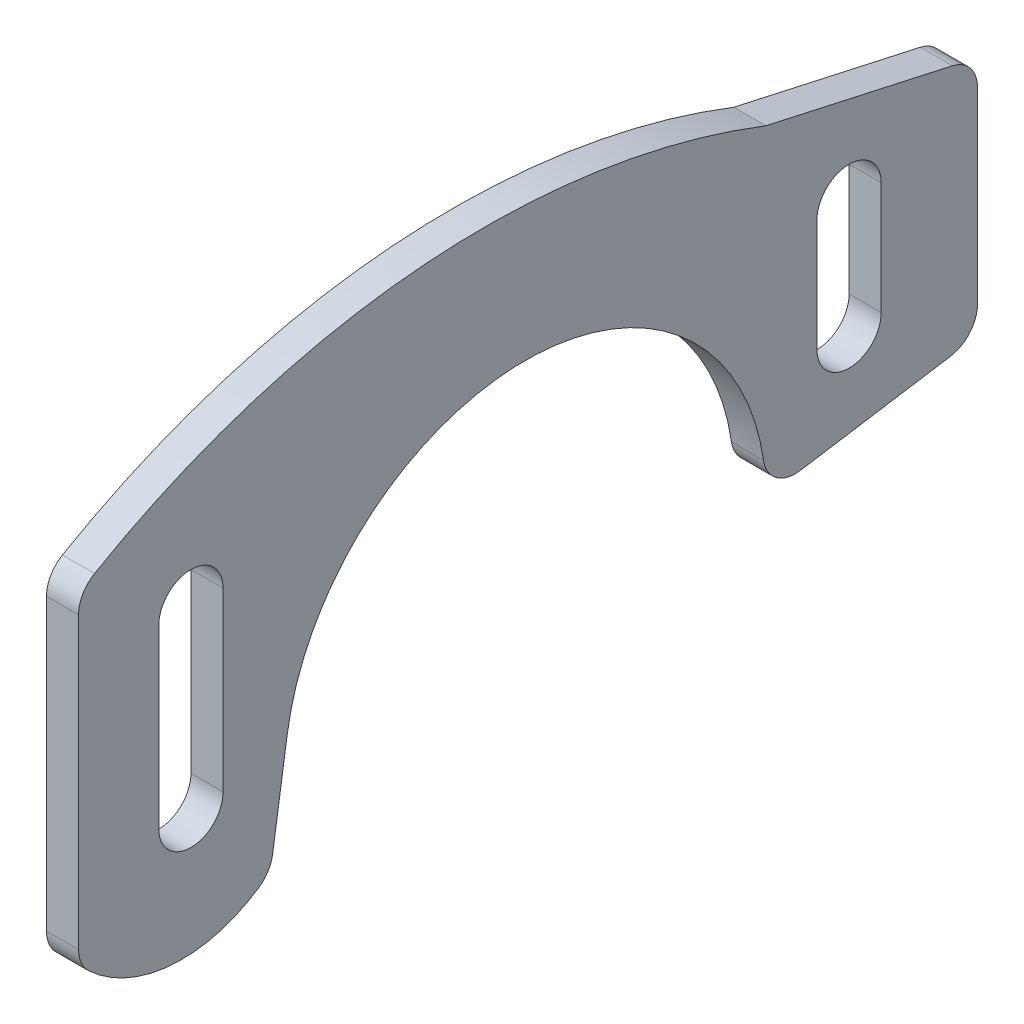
ISO-10303-21;
HEADER;
FILE_DESCRIPTION(('STEP AP214'),'2;1');
FILE_NAME('part.step','',(''),(''),'','','');
FILE_SCHEMA(('AUTOMOTIVE_DESIGN { 1 0 10303 214 1 1 1 1 }'));
ENDSEC;
DATA;
#1=APPLICATION_CONTEXT('core data for automotive mechanical design processes');
#2=APPLICATION_PROTOCOL_DEFINITION('international standard','automotive_design',2000,#1);
#3=PRODUCT_CONTEXT('',#1,'mechanical');
#4=PRODUCT('Part','Part','',(#3));
#5=PRODUCT_RELATED_PRODUCT_CATEGORY('part','',(#4));
#6=PRODUCT_DEFINITION_FORMATION('','',#4);
#7=PRODUCT_DEFINITION_CONTEXT('part definition',#1,'design');
#8=PRODUCT_DEFINITION('design','',#6,#7);
#9=PRODUCT_DEFINITION_SHAPE('','',#8);
#10=(LENGTH_UNIT() NAMED_UNIT(*) SI_UNIT(.MILLI.,.METRE.));
#11=(NAMED_UNIT(*) PLANE_ANGLE_UNIT() SI_UNIT($,.RADIAN.));
#12=(NAMED_UNIT(*) SI_UNIT($,.STERADIAN.) SOLID_ANGLE_UNIT());
#13=UNCERTAINTY_MEASURE_WITH_UNIT(LENGTH_MEASURE(1.E-05),#10,'distance_accuracy_value','');
#14=(GEOMETRIC_REPRESENTATION_CONTEXT(3) GLOBAL_UNCERTAINTY_ASSIGNED_CONTEXT((#13)) GLOBAL_UNIT_ASSIGNED_CONTEXT((#10,
#11,#12)) REPRESENTATION_CONTEXT('',''));
#15=CARTESIAN_POINT('',(0.,0.,0.));
#16=DIRECTION('',(0.,0.,1.));
#17=DIRECTION('',(1.,0.,0.));
#18=AXIS2_PLACEMENT_3D('',#15,#16,#17);
#19=CARTESIAN_POINT('',(2.,-16.3283950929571,-27.8306029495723));
#20=DIRECTION('',(-1.,0.,0.));
#21=DIRECTION('',(0.,0.,1.));
#22=AXIS2_PLACEMENT_3D('',#19,#20,#21);
#23=PLANE('',#22);
#24=CARTESIAN_POINT('',(2.,-4.1912536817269,-7.));
#25=DIRECTION('',(1.,0.,0.));
#26=DIRECTION('',(0.,0.,-1.));
#27=AXIS2_PLACEMENT_3D('',#24,#25,#26);
#28=CIRCLE('',#27,2.);
#29=CARTESIAN_POINT('',(2.,-4.1912536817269,-9.));
#30=VERTEX_POINT('',#29);
#31=CARTESIAN_POINT('',(2.,-4.1912536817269,-5.));
#32=VERTEX_POINT('',#31);
#33=EDGE_CURVE('E217',#30,#32,#28,.T.);
#34=ORIENTED_EDGE('',*,*,#33,.F.);
#35=DIRECTION('',(0.,1.,0.));
#36=VECTOR('',#35,1.);
#37=CARTESIAN_POINT('',(2.,-4.1912536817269,-9.));
#38=LINE('',#37,#36);
#39=CARTESIAN_POINT('',(2.,-15.1912536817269,-9.));
#40=VERTEX_POINT('',#39);
#41=EDGE_CURVE('E225',#40,#30,#38,.T.);
#42=ORIENTED_EDGE('',*,*,#41,.F.);
#43=CARTESIAN_POINT('',(2.,-15.1912536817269,-7.));
#44=DIRECTION('',(1.,0.,0.));
#45=DIRECTION('',(0.,0.,-1.));
#46=AXIS2_PLACEMENT_3D('',#43,#44,#45);
#47=CIRCLE('',#46,2.);
#48=CARTESIAN_POINT('',(2.,-15.1912536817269,-5.));
#49=VERTEX_POINT('',#48);
#50=EDGE_CURVE('E222',#49,#40,#47,.T.);
#51=ORIENTED_EDGE('',*,*,#50,.F.);
#52=DIRECTION('',(0.,-1.,0.));
#53=VECTOR('',#52,1.);
#54=CARTESIAN_POINT('',(2.,-4.1912536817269,-5.));
#55=LINE('',#54,#53);
#56=EDGE_CURVE('E219',#32,#49,#55,.T.);
#57=ORIENTED_EDGE('',*,*,#56,.F.);
#58=EDGE_LOOP('',(#34,#42,#51,#57));
#59=FACE_BOUND('',#58,.T.);
#60=CARTESIAN_POINT('',(2.,-16.3283950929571,-27.8306029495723));
#61=DIRECTION('',(-1.,0.,0.));
#62=DIRECTION('',(0.,0.,1.));
#63=AXIS2_PLACEMENT_3D('',#60,#61,#62);
#64=CIRCLE('',#63,15.);
#65=CARTESIAN_POINT('',(2.,-14.0804591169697,-13.));
#66=VERTEX_POINT('',#65);
#67=CARTESIAN_POINT('',(2.,-14.1444687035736,-42.6707668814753));
#68=VERTEX_POINT('',#67);
#69=EDGE_CURVE('E248',#66,#68,#64,.T.);
#70=ORIENTED_EDGE('',*,*,#69,.T.);
#71=CARTESIAN_POINT('',(2.,-13.8532785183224,-44.649455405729));
#72=DIRECTION('',(1.,0.,0.));
#73=DIRECTION('',(0.,0.,-1.));
#74=AXIS2_PLACEMENT_3D('',#71,#72,#73);
#75=CIRCLE('',#74,1.99999999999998);
#76=CARTESIAN_POINT('',(2.,-15.8286551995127,-44.9623243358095));
#77=VERTEX_POINT('',#76);
#78=EDGE_CURVE('E251',#68,#77,#75,.T.);
#79=ORIENTED_EDGE('',*,*,#78,.T.);
#80=DIRECTION('',(0.,0.156434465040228,-0.987688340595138));
#81=VECTOR('',#80,1.);
#82=CARTESIAN_POINT('',(2.,-14.3476744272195,-54.3128689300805));
#83=LINE('',#82,#81);
#84=CARTESIAN_POINT('',(2.,-14.3476744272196,-54.3128689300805));
#85=VERTEX_POINT('',#84);
#86=EDGE_CURVE('E254',#77,#85,#83,.T.);
#87=ORIENTED_EDGE('',*,*,#86,.T.);
#88=CARTESIAN_POINT('',(2.,-12.3722977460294,-54.));
#89=DIRECTION('',(1.,0.,0.));
#90=DIRECTION('',(0.,0.,1.));
#91=AXIS2_PLACEMENT_3D('',#88,#89,#90);
#92=CIRCLE('',#91,1.99999999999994);
#93=CARTESIAN_POINT('',(2.,-12.3722977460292,-56.));
#94=VERTEX_POINT('',#93);
#95=EDGE_CURVE('E256',#85,#94,#92,.T.);
#96=ORIENTED_EDGE('',*,*,#95,.T.);
#97=DIRECTION('',(0.,1.,0.));
#98=VECTOR('',#97,1.);
#99=CARTESIAN_POINT('',(2.,-0.686312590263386,-56.));
#100=LINE('',#99,#98);
#101=CARTESIAN_POINT('',(2.,-0.686312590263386,-56.));
#102=VERTEX_POINT('',#101);
#103=EDGE_CURVE('E258',#94,#102,#100,.T.);
#104=ORIENTED_EDGE('',*,*,#103,.T.);
#105=CARTESIAN_POINT('',(2.,-0.686312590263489,-54.));
#106=DIRECTION('',(1.,0.,0.));
#107=DIRECTION('',(0.,0.,1.));
#108=AXIS2_PLACEMENT_3D('',#105,#106,#107);
#109=CIRCLE('',#108,2.00000000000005);
#110=CARTESIAN_POINT('',(2.,1.26645925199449,-54.4320672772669));
#111=VERTEX_POINT('',#110);
#112=EDGE_CURVE('E260',#102,#111,#109,.T.);
#113=ORIENTED_EDGE('',*,*,#112,.T.);
#114=DIRECTION('',(0.,0.216033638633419,0.976385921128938));
#115=VECTOR('',#114,1.);
#116=CARTESIAN_POINT('',(2.,3.83357479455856,-42.8297284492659));
#117=LINE('',#116,#115);
#118=CARTESIAN_POINT('',(2.,3.83357479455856,-42.8297284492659));
#119=VERTEX_POINT('',#118);
#120=EDGE_CURVE('E262',#111,#119,#117,.T.);
#121=ORIENTED_EDGE('',*,*,#120,.T.);
#122=CARTESIAN_POINT('',(2.,-41.215448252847,-25.2755156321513));
#123=DIRECTION('',(1.,0.,0.));
#124=DIRECTION('',(0.,0.,1.));
#125=AXIS2_PLACEMENT_3D('',#122,#123,#124);
#126=CIRCLE('',#125,48.3483698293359);
#127=CARTESIAN_POINT('',(2.,0.594262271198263,-0.995627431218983));
#128=VERTEX_POINT('',#127);
#129=EDGE_CURVE('E264',#119,#128,#126,.T.);
#130=ORIENTED_EDGE('',*,*,#129,.T.);
#131=CARTESIAN_POINT('',(2.,-1.13525666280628,-2.));
#132=DIRECTION('',(1.,0.,0.));
#133=DIRECTION('',(0.,0.,1.));
#134=AXIS2_PLACEMENT_3D('',#131,#132,#133);
#135=CIRCLE('',#134,2.);
#136=CARTESIAN_POINT('',(2.,-1.13525666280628,0.));
#137=VERTEX_POINT('',#136);
#138=EDGE_CURVE('E266',#128,#137,#135,.T.);
#139=ORIENTED_EDGE('',*,*,#138,.T.);
#140=DIRECTION('',(0.,-1.,0.));
#141=VECTOR('',#140,1.);
#142=CARTESIAN_POINT('',(2.,-1.13525666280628,0.));
#143=LINE('',#142,#141);
#144=CARTESIAN_POINT('',(2.,-19.1985800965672,0.));
#145=VERTEX_POINT('',#144);
#146=EDGE_CURVE('E268',#137,#145,#143,.T.);
#147=ORIENTED_EDGE('',*,*,#146,.T.);
#148=CARTESIAN_POINT('',(2.,-19.1985800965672,-2.));
#149=DIRECTION('',(1.,0.,0.));
#150=DIRECTION('',(0.,0.,-1.));
#151=AXIS2_PLACEMENT_3D('',#148,#149,#150);
#152=CIRCLE('',#151,2.);
#153=CARTESIAN_POINT('',(2.,-20.6605779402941,-0.635242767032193));
#154=VERTEX_POINT('',#153);
#155=EDGE_CURVE('E270',#145,#154,#152,.T.);
#156=ORIENTED_EDGE('',*,*,#155,.T.);
#157=CARTESIAN_POINT('',(2.,-14.4470871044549,-6.43546100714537));
#158=DIRECTION('',(1.,0.,0.));
#159=DIRECTION('',(0.,0.,-1.));
#160=AXIS2_PLACEMENT_3D('',#157,#158,#159);
#161=CIRCLE('',#160,8.5);
#162=CARTESIAN_POINT('',(2.,-21.4596427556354,-11.2390079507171));
#163=VERTEX_POINT('',#162);
#164=EDGE_CURVE('E272',#154,#163,#161,.T.);
#165=ORIENTED_EDGE('',*,*,#164,.T.);
#166=CARTESIAN_POINT('',(2.,-19.8096296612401,-10.1087616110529));
#167=DIRECTION('',(1.,0.,0.));
#168=DIRECTION('',(0.,0.,-1.));
#169=AXIS2_PLACEMENT_3D('',#166,#167,#168);
#170=CIRCLE('',#169,2.00000000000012);
#171=CARTESIAN_POINT('',(2.,-20.1093544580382,-12.0861753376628));
#172=VERTEX_POINT('',#171);
#173=EDGE_CURVE('E274',#163,#172,#170,.T.);
#174=ORIENTED_EDGE('',*,*,#173,.T.);
#175=DIRECTION('',(0.,0.988706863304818,-0.149862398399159));
#176=VECTOR('',#175,1.);
#177=CARTESIAN_POINT('',(2.,-20.1093544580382,-12.0861753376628));
#178=LINE('',#177,#176);
#179=EDGE_CURVE('E276',#172,#66,#178,.T.);
#180=ORIENTED_EDGE('',*,*,#179,.T.);
#181=EDGE_LOOP('',(#70,#79,#87,#96,#104,#113,#121,#130,#139,#147,#156,#165,#174,#180));
#182=FACE_BOUND('',#181,.T.);
#183=CARTESIAN_POINT('',(2.,-2.82896306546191,-48.));
#184=DIRECTION('',(1.,0.,0.));
#185=DIRECTION('',(0.,0.,-1.));
#186=AXIS2_PLACEMENT_3D('',#183,#184,#185);
#187=CIRCLE('',#186,2.);
#188=CARTESIAN_POINT('',(2.,-2.82896306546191,-50.));
#189=VERTEX_POINT('',#188);
#190=CARTESIAN_POINT('',(2.,-2.82896306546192,-46.));
#191=VERTEX_POINT('',#190);
#192=EDGE_CURVE('E181',#189,#191,#187,.T.);
#193=ORIENTED_EDGE('',*,*,#192,.F.);
#194=DIRECTION('',(0.,1.,0.));
#195=VECTOR('',#194,1.);
#196=CARTESIAN_POINT('',(2.,-2.82896306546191,-50.));
#197=LINE('',#196,#195);
#198=CARTESIAN_POINT('',(2.,-9.82896306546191,-50.));
#199=VERTEX_POINT('',#198);
#200=EDGE_CURVE('E203',#199,#189,#197,.T.);
#201=ORIENTED_EDGE('',*,*,#200,.F.);
#202=CARTESIAN_POINT('',(2.,-9.82896306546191,-48.));
#203=DIRECTION('',(1.,0.,0.));
#204=DIRECTION('',(0.,0.,-1.));
#205=AXIS2_PLACEMENT_3D('',#202,#203,#204);
#206=CIRCLE('',#205,2.);
#207=CARTESIAN_POINT('',(2.,-9.82896306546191,-46.));
#208=VERTEX_POINT('',#207);
#209=EDGE_CURVE('E201',#208,#199,#206,.T.);
#210=ORIENTED_EDGE('',*,*,#209,.F.);
#211=DIRECTION('',(0.,-1.,0.));
#212=VECTOR('',#211,1.);
#213=CARTESIAN_POINT('',(2.,-2.82896306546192,-46.));
#214=LINE('',#213,#212);
#215=EDGE_CURVE('E189',#191,#208,#214,.T.);
#216=ORIENTED_EDGE('',*,*,#215,.F.);
#217=EDGE_LOOP('',(#193,#201,#210,#216));
#218=FACE_BOUND('',#217,.T.);
#219=ADVANCED_FACE('F32',(#59,#182,#218),#23,.F.);
#220=CARTESIAN_POINT('',(0.,-16.3283950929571,-27.8306029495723));
#221=DIRECTION('',(-1.,0.,0.));
#222=DIRECTION('',(0.,0.,1.));
#223=AXIS2_PLACEMENT_3D('',#220,#221,#222);
#224=PLANE('',#223);
#225=DIRECTION('',(0.,1.,0.));
#226=VECTOR('',#225,1.);
#227=CARTESIAN_POINT('',(0.,-4.1912536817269,-9.));
#228=LINE('',#227,#226);
#229=CARTESIAN_POINT('',(0.,-15.1912536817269,-9.));
#230=VERTEX_POINT('',#229);
#231=CARTESIAN_POINT('',(0.,-4.1912536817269,-9.));
#232=VERTEX_POINT('',#231);
#233=EDGE_CURVE('E220',#230,#232,#228,.T.);
#234=ORIENTED_EDGE('',*,*,#233,.T.);
#235=CARTESIAN_POINT('',(0.,-4.1912536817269,-7.));
#236=DIRECTION('',(1.,0.,0.));
#237=DIRECTION('',(0.,0.,-1.));
#238=AXIS2_PLACEMENT_3D('',#235,#236,#237);
#239=CIRCLE('',#238,2.);
#240=CARTESIAN_POINT('',(0.,-4.1912536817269,-5.));
#241=VERTEX_POINT('',#240);
#242=EDGE_CURVE('E197',#232,#241,#239,.T.);
#243=ORIENTED_EDGE('',*,*,#242,.T.);
#244=DIRECTION('',(0.,-1.,0.));
#245=VECTOR('',#244,1.);
#246=CARTESIAN_POINT('',(0.,-4.1912536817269,-5.));
#247=LINE('',#246,#245);
#248=CARTESIAN_POINT('',(0.,-15.1912536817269,-5.));
#249=VERTEX_POINT('',#248);
#250=EDGE_CURVE('E230',#241,#249,#247,.T.);
#251=ORIENTED_EDGE('',*,*,#250,.T.);
#252=CARTESIAN_POINT('',(0.,-15.1912536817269,-7.));
#253=DIRECTION('',(1.,0.,0.));
#254=DIRECTION('',(0.,0.,-1.));
#255=AXIS2_PLACEMENT_3D('',#252,#253,#254);
#256=CIRCLE('',#255,2.);
#257=EDGE_CURVE('E233',#249,#230,#256,.T.);
#258=ORIENTED_EDGE('',*,*,#257,.T.);
#259=EDGE_LOOP('',(#234,#243,#251,#258));
#260=FACE_BOUND('',#259,.T.);
#261=CARTESIAN_POINT('',(0.,-16.3283950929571,-27.8306029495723));
#262=DIRECTION('',(-1.,0.,0.));
#263=DIRECTION('',(0.,0.,1.));
#264=AXIS2_PLACEMENT_3D('',#261,#262,#263);
#265=CIRCLE('',#264,15.);
#266=CARTESIAN_POINT('',(0.,-14.0804591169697,-13.));
#267=VERTEX_POINT('',#266);
#268=CARTESIAN_POINT('',(0.,-14.1444687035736,-42.6707668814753));
#269=VERTEX_POINT('',#268);
#270=EDGE_CURVE('E247',#267,#269,#265,.T.);
#271=ORIENTED_EDGE('',*,*,#270,.F.);
#272=DIRECTION('',(0.,0.988706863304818,-0.149862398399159));
#273=VECTOR('',#272,1.);
#274=CARTESIAN_POINT('',(0.,-20.1093544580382,-12.0861753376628));
#275=LINE('',#274,#273);
#276=CARTESIAN_POINT('',(0.,-20.1093544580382,-12.0861753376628));
#277=VERTEX_POINT('',#276);
#278=EDGE_CURVE('E252',#277,#267,#275,.T.);
#279=ORIENTED_EDGE('',*,*,#278,.F.);
#280=CARTESIAN_POINT('',(0.,-19.8096296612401,-10.1087616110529));
#281=DIRECTION('',(1.,0.,0.));
#282=DIRECTION('',(0.,0.,-1.));
#283=AXIS2_PLACEMENT_3D('',#280,#281,#282);
#284=CIRCLE('',#283,2.00000000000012);
#285=CARTESIAN_POINT('',(0.,-21.4596427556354,-11.2390079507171));
#286=VERTEX_POINT('',#285);
#287=EDGE_CURVE('E303',#286,#277,#284,.T.);
#288=ORIENTED_EDGE('',*,*,#287,.F.);
#289=CARTESIAN_POINT('',(0.,-14.4470871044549,-6.43546100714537));
#290=DIRECTION('',(1.,0.,0.));
#291=DIRECTION('',(0.,0.,-1.));
#292=AXIS2_PLACEMENT_3D('',#289,#290,#291);
#293=CIRCLE('',#292,8.5);
#294=CARTESIAN_POINT('',(0.,-20.6605779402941,-0.635242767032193));
#295=VERTEX_POINT('',#294);
#296=EDGE_CURVE('E301',#295,#286,#293,.T.);
#297=ORIENTED_EDGE('',*,*,#296,.F.);
#298=CARTESIAN_POINT('',(0.,-19.1985800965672,-2.));
#299=DIRECTION('',(1.,0.,0.));
#300=DIRECTION('',(0.,0.,-1.));
#301=AXIS2_PLACEMENT_3D('',#298,#299,#300);
#302=CIRCLE('',#301,2.);
#303=CARTESIAN_POINT('',(0.,-19.1985800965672,0.));
#304=VERTEX_POINT('',#303);
#305=EDGE_CURVE('E299',#304,#295,#302,.T.);
#306=ORIENTED_EDGE('',*,*,#305,.F.);
#307=DIRECTION('',(0.,-1.,0.));
#308=VECTOR('',#307,1.);
#309=CARTESIAN_POINT('',(0.,-1.13525666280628,0.));
#310=LINE('',#309,#308);
#311=CARTESIAN_POINT('',(0.,-1.13525666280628,0.));
#312=VERTEX_POINT('',#311);
#313=EDGE_CURVE('E297',#312,#304,#310,.T.);
#314=ORIENTED_EDGE('',*,*,#313,.F.);
#315=CARTESIAN_POINT('',(0.,-1.13525666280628,-2.));
#316=DIRECTION('',(1.,0.,0.));
#317=DIRECTION('',(0.,0.,1.));
#318=AXIS2_PLACEMENT_3D('',#315,#316,#317);
#319=CIRCLE('',#318,2.);
#320=CARTESIAN_POINT('',(0.,0.594262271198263,-0.995627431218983));
#321=VERTEX_POINT('',#320);
#322=EDGE_CURVE('E295',#321,#312,#319,.T.);
#323=ORIENTED_EDGE('',*,*,#322,.F.);
#324=CARTESIAN_POINT('',(0.,-41.215448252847,-25.2755156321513));
#325=DIRECTION('',(1.,0.,0.));
#326=DIRECTION('',(0.,0.,1.));
#327=AXIS2_PLACEMENT_3D('',#324,#325,#326);
#328=CIRCLE('',#327,48.3483698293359);
#329=CARTESIAN_POINT('',(0.,3.83357479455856,-42.8297284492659));
#330=VERTEX_POINT('',#329);
#331=EDGE_CURVE('E293',#330,#321,#328,.T.);
#332=ORIENTED_EDGE('',*,*,#331,.F.);
#333=DIRECTION('',(0.,0.216033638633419,0.976385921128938));
#334=VECTOR('',#333,1.);
#335=CARTESIAN_POINT('',(0.,3.83357479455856,-42.8297284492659));
#336=LINE('',#335,#334);
#337=CARTESIAN_POINT('',(0.,1.26645925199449,-54.4320672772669));
#338=VERTEX_POINT('',#337);
#339=EDGE_CURVE('E291',#338,#330,#336,.T.);
#340=ORIENTED_EDGE('',*,*,#339,.F.);
#341=CARTESIAN_POINT('',(0.,-0.686312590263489,-54.));
#342=DIRECTION('',(1.,0.,0.));
#343=DIRECTION('',(0.,0.,1.));
#344=AXIS2_PLACEMENT_3D('',#341,#342,#343);
#345=CIRCLE('',#344,2.00000000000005);
#346=CARTESIAN_POINT('',(0.,-0.686312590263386,-56.));
#347=VERTEX_POINT('',#346);
#348=EDGE_CURVE('E289',#347,#338,#345,.T.);
#349=ORIENTED_EDGE('',*,*,#348,.F.);
#350=DIRECTION('',(0.,1.,0.));
#351=VECTOR('',#350,1.);
#352=CARTESIAN_POINT('',(0.,-0.686312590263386,-56.));
#353=LINE('',#352,#351);
#354=CARTESIAN_POINT('',(0.,-12.3722977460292,-56.));
#355=VERTEX_POINT('',#354);
#356=EDGE_CURVE('E287',#355,#347,#353,.T.);
#357=ORIENTED_EDGE('',*,*,#356,.F.);
#358=CARTESIAN_POINT('',(0.,-12.3722977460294,-54.));
#359=DIRECTION('',(1.,0.,0.));
#360=DIRECTION('',(0.,0.,1.));
#361=AXIS2_PLACEMENT_3D('',#358,#359,#360);
#362=CIRCLE('',#361,1.99999999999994);
#363=CARTESIAN_POINT('',(0.,-14.3476744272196,-54.3128689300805));
#364=VERTEX_POINT('',#363);
#365=EDGE_CURVE('E285',#364,#355,#362,.T.);
#366=ORIENTED_EDGE('',*,*,#365,.F.);
#367=DIRECTION('',(0.,0.156434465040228,-0.987688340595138));
#368=VECTOR('',#367,1.);
#369=CARTESIAN_POINT('',(0.,-14.3476744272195,-54.3128689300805));
#370=LINE('',#369,#368);
#371=CARTESIAN_POINT('',(0.,-15.8286551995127,-44.9623243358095));
#372=VERTEX_POINT('',#371);
#373=EDGE_CURVE('E283',#372,#364,#370,.T.);
#374=ORIENTED_EDGE('',*,*,#373,.F.);
#375=CARTESIAN_POINT('',(0.,-13.8532785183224,-44.649455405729));
#376=DIRECTION('',(1.,0.,0.));
#377=DIRECTION('',(0.,0.,-1.));
#378=AXIS2_PLACEMENT_3D('',#375,#376,#377);
#379=CIRCLE('',#378,1.99999999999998);
#380=EDGE_CURVE('E281',#269,#372,#379,.T.);
#381=ORIENTED_EDGE('',*,*,#380,.F.);
#382=EDGE_LOOP('',(#271,#279,#288,#297,#306,#314,#323,#332,#340,#349,#357,#366,#374,#381));
#383=FACE_BOUND('',#382,.T.);
#384=DIRECTION('',(0.,1.,0.));
#385=VECTOR('',#384,1.);
#386=CARTESIAN_POINT('',(0.,-2.82896306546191,-50.));
#387=LINE('',#386,#385);
#388=CARTESIAN_POINT('',(0.,-9.82896306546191,-50.));
#389=VERTEX_POINT('',#388);
#390=CARTESIAN_POINT('',(0.,-2.82896306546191,-50.));
#391=VERTEX_POINT('',#390);
#392=EDGE_CURVE('E190',#389,#391,#387,.T.);
#393=ORIENTED_EDGE('',*,*,#392,.T.);
#394=CARTESIAN_POINT('',(0.,-2.82896306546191,-48.));
#395=DIRECTION('',(1.,0.,0.));
#396=DIRECTION('',(0.,0.,-1.));
#397=AXIS2_PLACEMENT_3D('',#394,#395,#396);
#398=CIRCLE('',#397,2.);
#399=CARTESIAN_POINT('',(0.,-2.82896306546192,-46.));
#400=VERTEX_POINT('',#399);
#401=EDGE_CURVE('E55',#391,#400,#398,.T.);
#402=ORIENTED_EDGE('',*,*,#401,.T.);
#403=DIRECTION('',(0.,-1.,0.));
#404=VECTOR('',#403,1.);
#405=CARTESIAN_POINT('',(0.,-2.82896306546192,-46.));
#406=LINE('',#405,#404);
#407=CARTESIAN_POINT('',(0.,-9.82896306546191,-46.));
#408=VERTEX_POINT('',#407);
#409=EDGE_CURVE('E196',#400,#408,#406,.T.);
#410=ORIENTED_EDGE('',*,*,#409,.T.);
#411=CARTESIAN_POINT('',(0.,-9.82896306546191,-48.));
#412=DIRECTION('',(1.,0.,0.));
#413=DIRECTION('',(0.,0.,-1.));
#414=AXIS2_PLACEMENT_3D('',#411,#412,#413);
#415=CIRCLE('',#414,2.);
#416=EDGE_CURVE('E209',#408,#389,#415,.T.);
#417=ORIENTED_EDGE('',*,*,#416,.T.);
#418=EDGE_LOOP('',(#393,#402,#410,#417));
#419=FACE_BOUND('',#418,.T.);
#420=ADVANCED_FACE('F351',(#260,#383,#419),#224,.T.);
#421=CARTESIAN_POINT('',(2.,-16.3283950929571,-27.8306029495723));
#422=DIRECTION('',(-1.,0.,0.));
#423=DIRECTION('',(0.,0.,1.));
#424=AXIS2_PLACEMENT_3D('',#421,#422,#423);
#425=CYLINDRICAL_SURFACE('',#424,15.);
#426=ORIENTED_EDGE('',*,*,#270,.T.);
#427=DIRECTION('',(-1.,0.,0.));
#428=VECTOR('',#427,1.);
#429=CARTESIAN_POINT('',(2.,-14.1444687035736,-42.6707668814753));
#430=LINE('',#429,#428);
#431=EDGE_CURVE('E11',#68,#269,#430,.T.);
#432=ORIENTED_EDGE('',*,*,#431,.F.);
#433=ORIENTED_EDGE('',*,*,#69,.F.);
#434=DIRECTION('',(-1.,0.,0.));
#435=VECTOR('',#434,1.);
#436=CARTESIAN_POINT('',(2.,-14.0804591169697,-13.));
#437=LINE('',#436,#435);
#438=EDGE_CURVE('E278',#66,#267,#437,.T.);
#439=ORIENTED_EDGE('',*,*,#438,.T.);
#440=EDGE_LOOP('',(#426,#432,#433,#439));
#441=FACE_BOUND('',#440,.T.);
#442=ADVANCED_FACE('F34',(#441),#425,.F.);
#443=CARTESIAN_POINT('',(2.,-13.8532785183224,-44.649455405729));
#444=DIRECTION('',(-1.,0.,0.));
#445=DIRECTION('',(0.,0.,1.));
#446=AXIS2_PLACEMENT_3D('',#443,#444,#445);
#447=CYLINDRICAL_SURFACE('',#446,1.99999999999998);
#448=ORIENTED_EDGE('',*,*,#380,.T.);
#449=DIRECTION('',(-1.,0.,0.));
#450=VECTOR('',#449,1.);
#451=CARTESIAN_POINT('',(2.,-15.8286551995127,-44.9623243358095));
#452=LINE('',#451,#450);
#453=EDGE_CURVE('E40',#77,#372,#452,.T.);
#454=ORIENTED_EDGE('',*,*,#453,.F.);
#455=ORIENTED_EDGE('',*,*,#78,.F.);
#456=ORIENTED_EDGE('',*,*,#431,.T.);
#457=EDGE_LOOP('',(#448,#454,#455,#456));
#458=FACE_BOUND('',#457,.T.);
#459=ADVANCED_FACE('F368',(#458),#447,.T.);
#460=CARTESIAN_POINT('',(2.,-14.3476744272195,-54.3128689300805));
#461=DIRECTION('',(0.,0.987688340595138,0.156434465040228));
#462=DIRECTION('',(0.,-0.156434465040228,0.987688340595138));
#463=AXIS2_PLACEMENT_3D('',#460,#461,#462);
#464=PLANE('',#463);
#465=ORIENTED_EDGE('',*,*,#373,.T.);
#466=DIRECTION('',(-1.,0.,0.));
#467=VECTOR('',#466,1.);
#468=CARTESIAN_POINT('',(2.,-14.3476744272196,-54.3128689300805));
#469=LINE('',#468,#467);
#470=EDGE_CURVE('E338',#85,#364,#469,.T.);
#471=ORIENTED_EDGE('',*,*,#470,.F.);
#472=ORIENTED_EDGE('',*,*,#86,.F.);
#473=ORIENTED_EDGE('',*,*,#453,.T.);
#474=EDGE_LOOP('',(#465,#471,#472,#473));
#475=FACE_BOUND('',#474,.T.);
#476=ADVANCED_FACE('F345',(#475),#464,.F.);
#477=CARTESIAN_POINT('',(2.,-12.3722977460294,-54.));
#478=DIRECTION('',(-1.,0.,0.));
#479=DIRECTION('',(0.,0.,1.));
#480=AXIS2_PLACEMENT_3D('',#477,#478,#479);
#481=CYLINDRICAL_SURFACE('',#480,1.99999999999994);
#482=ORIENTED_EDGE('',*,*,#365,.T.);
#483=DIRECTION('',(-1.,0.,0.));
#484=VECTOR('',#483,1.);
#485=CARTESIAN_POINT('',(2.,-12.3722977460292,-56.));
#486=LINE('',#485,#484);
#487=EDGE_CURVE('E335',#94,#355,#486,.T.);
#488=ORIENTED_EDGE('',*,*,#487,.F.);
#489=ORIENTED_EDGE('',*,*,#95,.F.);
#490=ORIENTED_EDGE('',*,*,#470,.T.);
#491=EDGE_LOOP('',(#482,#488,#489,#490));
#492=FACE_BOUND('',#491,.T.);
#493=ADVANCED_FACE('F357',(#492),#481,.T.);
#494=CARTESIAN_POINT('',(2.,-0.686312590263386,-56.));
#495=DIRECTION('',(0.,0.,1.));
#496=DIRECTION('',(1.,0.,0.));
#497=AXIS2_PLACEMENT_3D('',#494,#495,#496);
#498=PLANE('',#497);
#499=ORIENTED_EDGE('',*,*,#356,.T.);
#500=DIRECTION('',(-1.,0.,0.));
#501=VECTOR('',#500,1.);
#502=CARTESIAN_POINT('',(2.,-0.686312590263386,-56.));
#503=LINE('',#502,#501);
#504=EDGE_CURVE('E332',#102,#347,#503,.T.);
#505=ORIENTED_EDGE('',*,*,#504,.F.);
#506=ORIENTED_EDGE('',*,*,#103,.F.);
#507=ORIENTED_EDGE('',*,*,#487,.T.);
#508=EDGE_LOOP('',(#499,#505,#506,#507));
#509=FACE_BOUND('',#508,.T.);
#510=ADVANCED_FACE('F361',(#509),#498,.F.);
#511=CARTESIAN_POINT('',(2.,-0.686312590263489,-54.));
#512=DIRECTION('',(-1.,0.,0.));
#513=DIRECTION('',(0.,0.,1.));
#514=AXIS2_PLACEMENT_3D('',#511,#512,#513);
#515=CYLINDRICAL_SURFACE('',#514,2.00000000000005);
#516=ORIENTED_EDGE('',*,*,#348,.T.);
#517=DIRECTION('',(-1.,0.,0.));
#518=VECTOR('',#517,1.);
#519=CARTESIAN_POINT('',(2.,1.26645925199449,-54.4320672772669));
#520=LINE('',#519,#518);
#521=EDGE_CURVE('E329',#111,#338,#520,.T.);
#522=ORIENTED_EDGE('',*,*,#521,.F.);
#523=ORIENTED_EDGE('',*,*,#112,.F.);
#524=ORIENTED_EDGE('',*,*,#504,.T.);
#525=EDGE_LOOP('',(#516,#522,#523,#524));
#526=FACE_BOUND('',#525,.T.);
#527=ADVANCED_FACE('F411',(#526),#515,.T.);
#528=CARTESIAN_POINT('',(2.,3.83357479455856,-42.8297284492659));
#529=DIRECTION('',(0.,-0.976385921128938,0.216033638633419));
#530=DIRECTION('',(0.,-0.216033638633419,-0.976385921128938));
#531=AXIS2_PLACEMENT_3D('',#528,#529,#530);
#532=PLANE('',#531);
#533=ORIENTED_EDGE('',*,*,#339,.T.);
#534=DIRECTION('',(-1.,0.,0.));
#535=VECTOR('',#534,1.);
#536=CARTESIAN_POINT('',(2.,3.83357479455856,-42.8297284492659));
#537=LINE('',#536,#535);
#538=EDGE_CURVE('E326',#119,#330,#537,.T.);
#539=ORIENTED_EDGE('',*,*,#538,.F.);
#540=ORIENTED_EDGE('',*,*,#120,.F.);
#541=ORIENTED_EDGE('',*,*,#521,.T.);
#542=EDGE_LOOP('',(#533,#539,#540,#541));
#543=FACE_BOUND('',#542,.T.);
#544=ADVANCED_FACE('F409',(#543),#532,.F.);
#545=CARTESIAN_POINT('',(2.,-41.215448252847,-25.2755156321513));
#546=DIRECTION('',(-1.,0.,0.));
#547=DIRECTION('',(0.,0.,1.));
#548=AXIS2_PLACEMENT_3D('',#545,#546,#547);
#549=CYLINDRICAL_SURFACE('',#548,48.3483698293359);
#550=ORIENTED_EDGE('',*,*,#331,.T.);
#551=DIRECTION('',(-1.,0.,0.));
#552=VECTOR('',#551,1.);
#553=CARTESIAN_POINT('',(2.,0.594262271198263,-0.995627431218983));
#554=LINE('',#553,#552);
#555=EDGE_CURVE('E323',#128,#321,#554,.T.);
#556=ORIENTED_EDGE('',*,*,#555,.F.);
#557=ORIENTED_EDGE('',*,*,#129,.F.);
#558=ORIENTED_EDGE('',*,*,#538,.T.);
#559=EDGE_LOOP('',(#550,#556,#557,#558));
#560=FACE_BOUND('',#559,.T.);
#561=ADVANCED_FACE('F404',(#560),#549,.T.);
#562=CARTESIAN_POINT('',(2.,-1.13525666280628,-2.));
#563=DIRECTION('',(-1.,0.,0.));
#564=DIRECTION('',(0.,0.,1.));
#565=AXIS2_PLACEMENT_3D('',#562,#563,#564);
#566=CYLINDRICAL_SURFACE('',#565,2.);
#567=ORIENTED_EDGE('',*,*,#322,.T.);
#568=DIRECTION('',(-1.,0.,0.));
#569=VECTOR('',#568,1.);
#570=CARTESIAN_POINT('',(2.,-1.13525666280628,0.));
#571=LINE('',#570,#569);
#572=EDGE_CURVE('E320',#137,#312,#571,.T.);
#573=ORIENTED_EDGE('',*,*,#572,.F.);
#574=ORIENTED_EDGE('',*,*,#138,.F.);
#575=ORIENTED_EDGE('',*,*,#555,.T.);
#576=EDGE_LOOP('',(#567,#573,#574,#575));
#577=FACE_BOUND('',#576,.T.);
#578=ADVANCED_FACE('F399',(#577),#566,.T.);
#579=CARTESIAN_POINT('',(2.,-1.13525666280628,0.));
#580=DIRECTION('',(0.,0.,-1.));
#581=DIRECTION('',(0.,1.,0.));
#582=AXIS2_PLACEMENT_3D('',#579,#580,#581);
#583=PLANE('',#582);
#584=ORIENTED_EDGE('',*,*,#313,.T.);
#585=DIRECTION('',(-1.,0.,0.));
#586=VECTOR('',#585,1.);
#587=CARTESIAN_POINT('',(2.,-19.1985800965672,0.));
#588=LINE('',#587,#586);
#589=EDGE_CURVE('E317',#145,#304,#588,.T.);
#590=ORIENTED_EDGE('',*,*,#589,.F.);
#591=ORIENTED_EDGE('',*,*,#146,.F.);
#592=ORIENTED_EDGE('',*,*,#572,.T.);
#593=EDGE_LOOP('',(#584,#590,#591,#592));
#594=FACE_BOUND('',#593,.T.);
#595=ADVANCED_FACE('F395',(#594),#583,.F.);
#596=CARTESIAN_POINT('',(2.,-19.1985800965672,-2.));
#597=DIRECTION('',(-1.,0.,0.));
#598=DIRECTION('',(0.,0.,1.));
#599=AXIS2_PLACEMENT_3D('',#596,#597,#598);
#600=CYLINDRICAL_SURFACE('',#599,2.);
#601=ORIENTED_EDGE('',*,*,#305,.T.);
#602=DIRECTION('',(-1.,0.,0.));
#603=VECTOR('',#602,1.);
#604=CARTESIAN_POINT('',(2.,-20.6605779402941,-0.635242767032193));
#605=LINE('',#604,#603);
#606=EDGE_CURVE('E314',#154,#295,#605,.T.);
#607=ORIENTED_EDGE('',*,*,#606,.F.);
#608=ORIENTED_EDGE('',*,*,#155,.F.);
#609=ORIENTED_EDGE('',*,*,#589,.T.);
#610=EDGE_LOOP('',(#601,#607,#608,#609));
#611=FACE_BOUND('',#610,.T.);
#612=ADVANCED_FACE('F390',(#611),#600,.T.);
#613=CARTESIAN_POINT('',(2.,-14.4470871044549,-6.43546100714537));
#614=DIRECTION('',(-1.,0.,0.));
#615=DIRECTION('',(0.,0.,1.));
#616=AXIS2_PLACEMENT_3D('',#613,#614,#615);
#617=CYLINDRICAL_SURFACE('',#616,8.5);
#618=ORIENTED_EDGE('',*,*,#296,.T.);
#619=DIRECTION('',(-1.,0.,0.));
#620=VECTOR('',#619,1.);
#621=CARTESIAN_POINT('',(2.,-21.4596427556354,-11.2390079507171));
#622=LINE('',#621,#620);
#623=EDGE_CURVE('E311',#163,#286,#622,.T.);
#624=ORIENTED_EDGE('',*,*,#623,.F.);
#625=ORIENTED_EDGE('',*,*,#164,.F.);
#626=ORIENTED_EDGE('',*,*,#606,.T.);
#627=EDGE_LOOP('',(#618,#624,#625,#626));
#628=FACE_BOUND('',#627,.T.);
#629=ADVANCED_FACE('F384',(#628),#617,.T.);
#630=CARTESIAN_POINT('',(2.,-19.8096296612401,-10.1087616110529));
#631=DIRECTION('',(-1.,0.,0.));
#632=DIRECTION('',(0.,0.,1.));
#633=AXIS2_PLACEMENT_3D('',#630,#631,#632);
#634=CYLINDRICAL_SURFACE('',#633,2.00000000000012);
#635=ORIENTED_EDGE('',*,*,#287,.T.);
#636=DIRECTION('',(-1.,0.,0.));
#637=VECTOR('',#636,1.);
#638=CARTESIAN_POINT('',(2.,-20.1093544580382,-12.0861753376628));
#639=LINE('',#638,#637);
#640=EDGE_CURVE('E308',#172,#277,#639,.T.);
#641=ORIENTED_EDGE('',*,*,#640,.F.);
#642=ORIENTED_EDGE('',*,*,#173,.F.);
#643=ORIENTED_EDGE('',*,*,#623,.T.);
#644=EDGE_LOOP('',(#635,#641,#642,#643));
#645=FACE_BOUND('',#644,.T.);
#646=ADVANCED_FACE('F380',(#645),#634,.T.);
#647=CARTESIAN_POINT('',(2.,-20.1093544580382,-12.0861753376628));
#648=DIRECTION('',(0.,0.149862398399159,0.988706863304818));
#649=DIRECTION('',(0.,-0.988706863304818,0.149862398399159));
#650=AXIS2_PLACEMENT_3D('',#647,#648,#649);
#651=PLANE('',#650);
#652=ORIENTED_EDGE('',*,*,#278,.T.);
#653=ORIENTED_EDGE('',*,*,#438,.F.);
#654=ORIENTED_EDGE('',*,*,#179,.F.);
#655=ORIENTED_EDGE('',*,*,#640,.T.);
#656=EDGE_LOOP('',(#652,#653,#654,#655));
#657=FACE_BOUND('',#656,.T.);
#658=ADVANCED_FACE('F375',(#657),#651,.F.);
#659=CARTESIAN_POINT('',(2.,-4.1912536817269,-7.));
#660=DIRECTION('',(-1.,0.,0.));
#661=DIRECTION('',(0.,0.,1.));
#662=AXIS2_PLACEMENT_3D('',#659,#660,#661);
#663=CYLINDRICAL_SURFACE('',#662,2.);
#664=ORIENTED_EDGE('',*,*,#242,.F.);
#665=DIRECTION('',(-1.,0.,0.));
#666=VECTOR('',#665,1.);
#667=CARTESIAN_POINT('',(2.,-4.1912536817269,-9.));
#668=LINE('',#667,#666);
#669=EDGE_CURVE('E227',#30,#232,#668,.T.);
#670=ORIENTED_EDGE('',*,*,#669,.F.);
#671=ORIENTED_EDGE('',*,*,#33,.T.);
#672=DIRECTION('',(-1.,0.,0.));
#673=VECTOR('',#672,1.);
#674=CARTESIAN_POINT('',(2.,-4.1912536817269,-5.));
#675=LINE('',#674,#673);
#676=EDGE_CURVE('E244',#32,#241,#675,.T.);
#677=ORIENTED_EDGE('',*,*,#676,.T.);
#678=EDGE_LOOP('',(#664,#670,#671,#677));
#679=FACE_BOUND('',#678,.T.);
#680=ADVANCED_FACE('F430',(#679),#663,.F.);
#681=CARTESIAN_POINT('',(2.,-4.1912536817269,-5.));
#682=DIRECTION('',(0.,0.,-1.));
#683=DIRECTION('',(0.,1.,0.));
#684=AXIS2_PLACEMENT_3D('',#681,#682,#683);
#685=PLANE('',#684);
#686=ORIENTED_EDGE('',*,*,#250,.F.);
#687=ORIENTED_EDGE('',*,*,#676,.F.);
#688=ORIENTED_EDGE('',*,*,#56,.T.);
#689=DIRECTION('',(-1.,0.,0.));
#690=VECTOR('',#689,1.);
#691=CARTESIAN_POINT('',(2.,-15.1912536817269,-5.));
#692=LINE('',#691,#690);
#693=EDGE_CURVE('E242',#49,#249,#692,.T.);
#694=ORIENTED_EDGE('',*,*,#693,.T.);
#695=EDGE_LOOP('',(#686,#687,#688,#694));
#696=FACE_BOUND('',#695,.T.);
#697=ADVANCED_FACE('F480',(#696),#685,.T.);
#698=CARTESIAN_POINT('',(2.,-15.1912536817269,-7.));
#699=DIRECTION('',(-1.,0.,0.));
#700=DIRECTION('',(0.,0.,1.));
#701=AXIS2_PLACEMENT_3D('',#698,#699,#700);
#702=CYLINDRICAL_SURFACE('',#701,2.);
#703=ORIENTED_EDGE('',*,*,#257,.F.);
#704=ORIENTED_EDGE('',*,*,#693,.F.);
#705=ORIENTED_EDGE('',*,*,#50,.T.);
#706=DIRECTION('',(-1.,0.,0.));
#707=VECTOR('',#706,1.);
#708=CARTESIAN_POINT('',(2.,-15.1912536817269,-9.));
#709=LINE('',#708,#707);
#710=EDGE_CURVE('E240',#40,#230,#709,.T.);
#711=ORIENTED_EDGE('',*,*,#710,.T.);
#712=EDGE_LOOP('',(#703,#704,#705,#711));
#713=FACE_BOUND('',#712,.T.);
#714=ADVANCED_FACE('F487',(#713),#702,.F.);
#715=CARTESIAN_POINT('',(2.,-4.1912536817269,-9.));
#716=DIRECTION('',(0.,0.,1.));
#717=DIRECTION('',(0.,-1.,0.));
#718=AXIS2_PLACEMENT_3D('',#715,#716,#717);
#719=PLANE('',#718);
#720=ORIENTED_EDGE('',*,*,#233,.F.);
#721=ORIENTED_EDGE('',*,*,#710,.F.);
#722=ORIENTED_EDGE('',*,*,#41,.T.);
#723=ORIENTED_EDGE('',*,*,#669,.T.);
#724=EDGE_LOOP('',(#720,#721,#722,#723));
#725=FACE_BOUND('',#724,.T.);
#726=ADVANCED_FACE('F494',(#725),#719,.T.);
#727=CARTESIAN_POINT('',(2.,-2.82896306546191,-48.));
#728=DIRECTION('',(-1.,0.,0.));
#729=DIRECTION('',(0.,0.,1.));
#730=AXIS2_PLACEMENT_3D('',#727,#728,#729);
#731=CYLINDRICAL_SURFACE('',#730,2.);
#732=ORIENTED_EDGE('',*,*,#401,.F.);
#733=DIRECTION('',(-1.,0.,0.));
#734=VECTOR('',#733,1.);
#735=CARTESIAN_POINT('',(2.,-2.82896306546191,-50.));
#736=LINE('',#735,#734);
#737=EDGE_CURVE('E185',#189,#391,#736,.T.);
#738=ORIENTED_EDGE('',*,*,#737,.F.);
#739=ORIENTED_EDGE('',*,*,#192,.T.);
#740=DIRECTION('',(-1.,0.,0.));
#741=VECTOR('',#740,1.);
#742=CARTESIAN_POINT('',(2.,-2.82896306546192,-46.));
#743=LINE('',#742,#741);
#744=EDGE_CURVE('E184',#191,#400,#743,.T.);
#745=ORIENTED_EDGE('',*,*,#744,.T.);
#746=EDGE_LOOP('',(#732,#738,#739,#745));
#747=FACE_BOUND('',#746,.T.);
#748=ADVANCED_FACE('F183',(#747),#731,.F.);
#749=CARTESIAN_POINT('',(2.,-2.82896306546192,-46.));
#750=DIRECTION('',(0.,0.,-1.));
#751=DIRECTION('',(-1.,0.,0.));
#752=AXIS2_PLACEMENT_3D('',#749,#750,#751);
#753=PLANE('',#752);
#754=ORIENTED_EDGE('',*,*,#409,.F.);
#755=ORIENTED_EDGE('',*,*,#744,.F.);
#756=ORIENTED_EDGE('',*,*,#215,.T.);
#757=DIRECTION('',(-1.,0.,0.));
#758=VECTOR('',#757,1.);
#759=CARTESIAN_POINT('',(2.,-9.82896306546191,-46.));
#760=LINE('',#759,#758);
#761=EDGE_CURVE('E198',#208,#408,#760,.T.);
#762=ORIENTED_EDGE('',*,*,#761,.T.);
#763=EDGE_LOOP('',(#754,#755,#756,#762));
#764=FACE_BOUND('',#763,.T.);
#765=ADVANCED_FACE('F193',(#764),#753,.T.);
#766=CARTESIAN_POINT('',(2.,-9.82896306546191,-48.));
#767=DIRECTION('',(-1.,0.,0.));
#768=DIRECTION('',(0.,0.,1.));
#769=AXIS2_PLACEMENT_3D('',#766,#767,#768);
#770=CYLINDRICAL_SURFACE('',#769,2.);
#771=ORIENTED_EDGE('',*,*,#416,.F.);
#772=ORIENTED_EDGE('',*,*,#761,.F.);
#773=ORIENTED_EDGE('',*,*,#209,.T.);
#774=DIRECTION('',(-1.,0.,0.));
#775=VECTOR('',#774,1.);
#776=CARTESIAN_POINT('',(2.,-9.82896306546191,-50.));
#777=LINE('',#776,#775);
#778=EDGE_CURVE('E47',#199,#389,#777,.T.);
#779=ORIENTED_EDGE('',*,*,#778,.T.);
#780=EDGE_LOOP('',(#771,#772,#773,#779));
#781=FACE_BOUND('',#780,.T.);
#782=ADVANCED_FACE('F515',(#781),#770,.F.);
#783=CARTESIAN_POINT('',(2.,-2.82896306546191,-50.));
#784=DIRECTION('',(0.,0.,1.));
#785=DIRECTION('',(1.,0.,0.));
#786=AXIS2_PLACEMENT_3D('',#783,#784,#785);
#787=PLANE('',#786);
#788=ORIENTED_EDGE('',*,*,#392,.F.);
#789=ORIENTED_EDGE('',*,*,#778,.F.);
#790=ORIENTED_EDGE('',*,*,#200,.T.);
#791=ORIENTED_EDGE('',*,*,#737,.T.);
#792=EDGE_LOOP('',(#788,#789,#790,#791));
#793=FACE_BOUND('',#792,.T.);
#794=ADVANCED_FACE('F522',(#793),#787,.T.);
#795=CLOSED_SHELL('',(#219,#420,#442,#459,#476,#493,#510,#527,#544,#561,#578,#595,#612,#629,
#646,#658,#680,#697,#714,#726,#748,#765,#782,#794));
#796=MANIFOLD_SOLID_BREP('B2',#795);
#797=ADVANCED_BREP_SHAPE_REPRESENTATION('',(#18,#796),#14);
#798=SHAPE_DEFINITION_REPRESENTATION(#9,#797);
ENDSEC;
END-ISO-10303-21;
